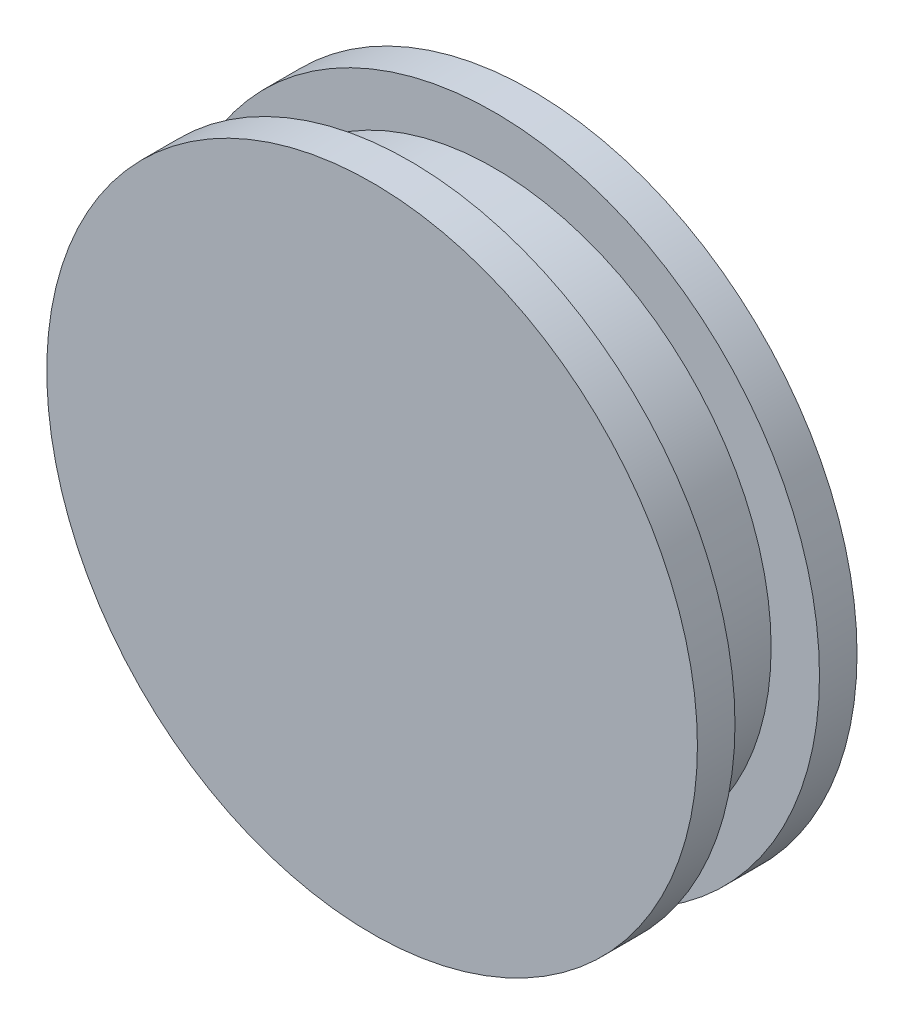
from build123d import *


with BuildPart() as part:
    # Sketch1 → Revolve1 (revolve)
    with BuildSketch(Plane(origin=(0, 0, 0), x_dir=(1, 0, 0), z_dir=(0, 1, 0))):
        Polygon((0, 0), (8.8011, 0), (8.8011, 1.016), (7.493, 1.016), (7.493, 3.302), (8.8011, 3.302), (8.8011, 4.318), (0, 4.318), align=None)
    revolve(axis=Axis((0, 0, 0), (0, 0, -1)))


solid = part.part
